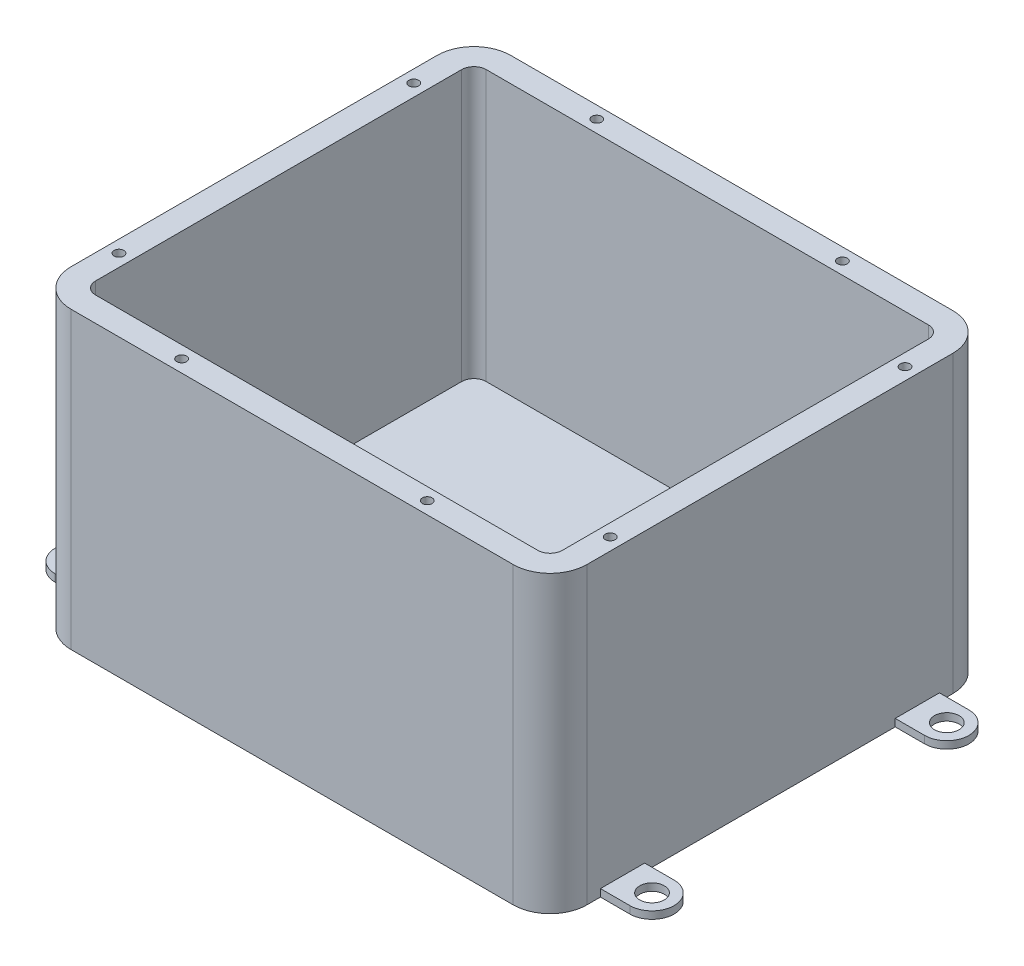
from build123d import *

# Parameters (mm, degrees)
BOSS_EXTRUDE1_DEPTH = 225
SHELL1_T            = 10
FILLET1_R           = 15
SKETCH2_R           = 5
BOSS_EXTRUDE2_DEPTH = 3
SKETCH3_R           = 2
CUT_EXTRUDE2_DEPTH  = 20


with BuildPart() as part:
    # Sketch1 → Boss-Extrude1 (new body)
    with BuildSketch(Plane(origin=(0, 0, 0), x_dir=(1, 0, 0), z_dir=(0, 1, 0))):
        with BuildLine():
            Line((-90, -89.5), (90, -89.5))
            ThreePointArc((90, -89.5), (100.606601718, -85.106601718), (105, -74.5))
            Line((105, -74.5), (105, 74.5))
            ThreePointArc((105, 74.5), (100.606601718, 85.106601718), (90, 89.5))
            Line((90, 89.5), (-90, 89.5))
            ThreePointArc((-90, 89.5), (-100.606601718, 85.106601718), (-105, 74.5))
            Line((-105, 74.5), (-105, -74.5))
            ThreePointArc((-105, -74.5), (-100.606601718, -85.106601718), (-90, -89.5))
        make_face()
    extrude(amount=BOSS_EXTRUDE1_DEPTH)

    # Shell1 (no face opened: a closed hollow body)
    add(offset(amount=-SHELL1_T, mode=Mode.PRIVATE), mode=Mode.SUBTRACT)

    # Fillet1
    fillet1_edges = [part.edges().sort_by_distance(p)[0] for p in [
        (100.606601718, 225, 85.106601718),
        (105, 225, 0),
        (100.606601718, 225, -85.106601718),
        (0, 225, -89.5),
        (-100.606601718, 225, -85.106601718),
        (-105, 225, 0),
        (-100.606601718, 225, 85.106601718),
        (0, 225, 89.5),
    ]]
    fillet(fillet1_edges, radius=FILLET1_R)

    # Sketch2 → Boss-Extrude2 (add)
    # profile 1 of 4: a face of its own
    with BuildSketch(Plane(origin=(0, 0, 0), x_dir=(1, 0, 0), z_dir=(0, 1, 0))):
        with BuildLine():
            Line((-117, 51), (-105, 51))
            Line((-105, 51), (-105, 69))
            Line((-105, 69), (-117, 69))
            ThreePointArc((-117, 69), (-126, 60), (-117, 51))
        make_face()
        with Locations(Location((-117, 60, 0), (0, 0, 270))):
            Circle(SKETCH2_R, mode=Mode.SUBTRACT)
    # profile 2 of 4: a face of its own
    with BuildSketch(Plane(origin=(0, 0, 0), x_dir=(1, 0, 0), z_dir=(0, 1, 0))):
        with BuildLine():
            Line((-105, -69), (-117, -69))
            ThreePointArc((-117, -69), (-126, -60), (-117, -51))
            Line((-117, -51), (-105, -51))
            Line((-105, -51), (-105, -69))
        make_face()
        with Locations(Location((-117, -60, 0), (0, 0, 90))):
            Circle(SKETCH2_R, mode=Mode.SUBTRACT)
    # profile 3 of 4: a face of its own
    with BuildSketch(Plane(origin=(0, 0, 0), x_dir=(1, 0, 0), z_dir=(0, 1, 0))):
        with BuildLine():
            Line((117, -51), (105, -51))
            Line((105, -51), (105, -69))
            Line((105, -69), (117, -69))
            ThreePointArc((117, -69), (126, -60), (117, -51))
        make_face()
        with Locations(Location((117, -60, 0), (0, 0, 270))):
            Circle(SKETCH2_R, mode=Mode.SUBTRACT)
    # profile 4 of 4: a face of its own
    with BuildSketch(Plane(origin=(0, 0, 0), x_dir=(1, 0, 0), z_dir=(0, 1, 0))):
        with BuildLine():
            Line((105, 69), (117, 69))
            ThreePointArc((117, 69), (126, 60), (117, 51))
            Line((117, 51), (105, 51))
            Line((105, 51), (105, 69))
        make_face()
        with Locations(Location((117, 60, 0), (0, 0, 90))):
            Circle(SKETCH2_R, mode=Mode.SUBTRACT)
    extrude(amount=BOSS_EXTRUDE2_DEPTH)

    # SurfaceCut1
    split(bisect_by=Plane(origin=(0, 120, 0), x_dir=(1, 0, 0), z_dir=(0, 1, 0)), keep=Keep.BOTTOM)

    # Sketch3 → Cut-Extrude2 (cut)
    with BuildSketch(Plane(origin=(0, 120, 0), x_dir=(1, 0, 0), z_dir=(0, 1, 0))):
        with Locations(Location((-50, 84.5, 0), (0, 0, 270))):
            Circle(SKETCH3_R)
        with Locations(Location((50, 84.5, 0), (0, 0, 90))):
            Circle(SKETCH3_R)
        with Locations(Location((-50, -84.5, 0), (0, 0, 90))):
            Circle(SKETCH3_R)
        with Locations(Location((50, -84.5, 0), (0, 0, 270))):
            Circle(SKETCH3_R)
        with Locations(Location((-100, 60, 0), (0, 0, 270))):
            Circle(SKETCH3_R)
        with Locations(Location((-100, -60, 0), (0, 0, 90))):
            Circle(SKETCH3_R)
        with Locations(Location((100, -60, 0), (0, 0, 270))):
            Circle(SKETCH3_R)
        with Locations(Location((100, 60, 0), (0, 0, 90))):
            Circle(SKETCH3_R)
    extrude(amount=-CUT_EXTRUDE2_DEPTH, mode=Mode.SUBTRACT)


solid = part.part
